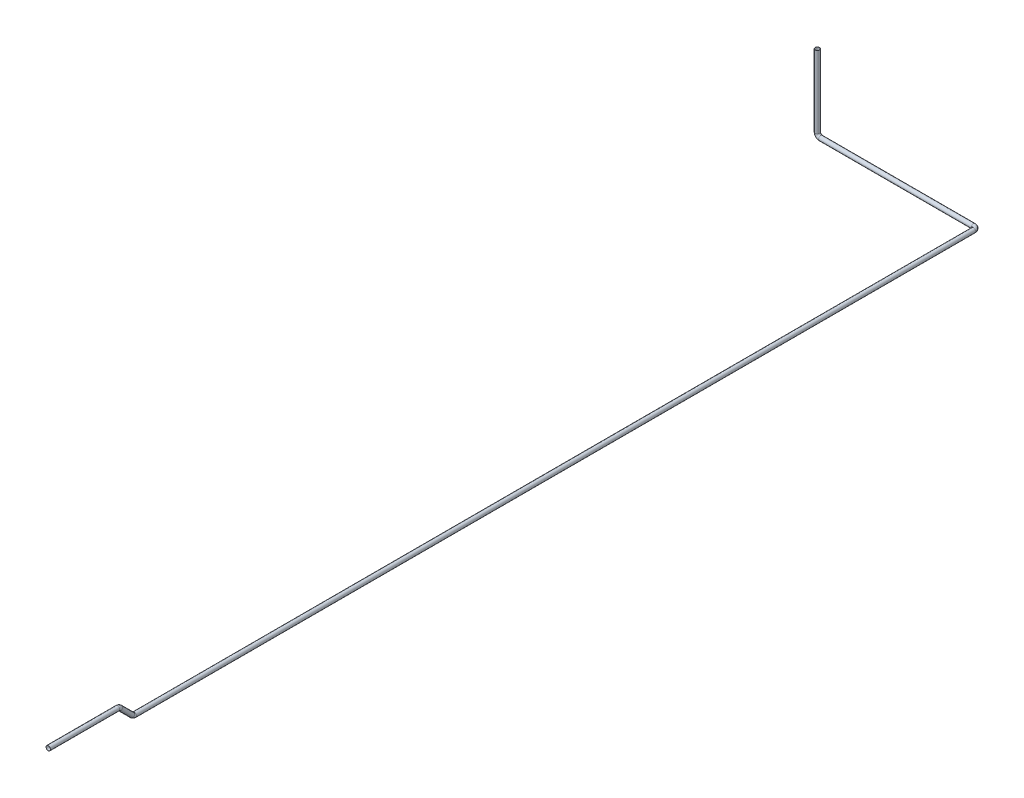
ISO-10303-21;
HEADER;
FILE_DESCRIPTION(('STEP AP214'),'2;1');
FILE_NAME('part.step','',(''),(''),'','','');
FILE_SCHEMA(('AUTOMOTIVE_DESIGN { 1 0 10303 214 1 1 1 1 }'));
ENDSEC;
DATA;
#1=APPLICATION_CONTEXT('core data for automotive mechanical design processes');
#2=APPLICATION_PROTOCOL_DEFINITION('international standard','automotive_design',2000,#1);
#3=PRODUCT_CONTEXT('',#1,'mechanical');
#4=PRODUCT('Part','Part','',(#3));
#5=PRODUCT_RELATED_PRODUCT_CATEGORY('part','',(#4));
#6=PRODUCT_DEFINITION_FORMATION('','',#4);
#7=PRODUCT_DEFINITION_CONTEXT('part definition',#1,'design');
#8=PRODUCT_DEFINITION('design','',#6,#7);
#9=PRODUCT_DEFINITION_SHAPE('','',#8);
#10=(LENGTH_UNIT() NAMED_UNIT(*) SI_UNIT(.MILLI.,.METRE.));
#11=(NAMED_UNIT(*) PLANE_ANGLE_UNIT() SI_UNIT($,.RADIAN.));
#12=(NAMED_UNIT(*) SI_UNIT($,.STERADIAN.) SOLID_ANGLE_UNIT());
#13=UNCERTAINTY_MEASURE_WITH_UNIT(LENGTH_MEASURE(1.E-05),#10,'distance_accuracy_value','');
#14=(GEOMETRIC_REPRESENTATION_CONTEXT(3) GLOBAL_UNCERTAINTY_ASSIGNED_CONTEXT((#13)) GLOBAL_UNIT_ASSIGNED_CONTEXT((#10,
#11,#12)) REPRESENTATION_CONTEXT('',''));
#15=CARTESIAN_POINT('',(0.,0.,0.));
#16=DIRECTION('',(0.,0.,1.));
#17=DIRECTION('',(1.,0.,0.));
#18=AXIS2_PLACEMENT_3D('',#15,#16,#17);
#19=CARTESIAN_POINT('',(2279.99999999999,-880.000000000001,12280.7106781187));
#20=DIRECTION('',(0.,0.,1.));
#21=DIRECTION('',(0.,-1.,0.));
#22=AXIS2_PLACEMENT_3D('',#19,#20,#21);
#23=CYLINDRICAL_SURFACE('',#22,31.75);
#24=CARTESIAN_POINT('',(2279.99999999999,-880.000000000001,12280.7106781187));
#25=DIRECTION('',(0.,0.,-1.));
#26=DIRECTION('',(-1.,0.,0.));
#27=AXIS2_PLACEMENT_3D('',#24,#25,#26);
#28=CIRCLE('',#27,31.75);
#29=CARTESIAN_POINT('',(2279.99999999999,-848.25,12280.7106781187));
#30=VERTEX_POINT('',#29);
#31=EDGE_CURVE('E41',#30,#30,#28,.T.);
#32=ORIENTED_EDGE('',*,*,#31,.F.);
#33=EDGE_LOOP('',(#32));
#34=FACE_BOUND('',#33,.T.);
#35=CARTESIAN_POINT('',(2279.99999999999,-880.000000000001,13270.));
#36=DIRECTION('',(0.,0.,-1.));
#37=DIRECTION('',(-1.,0.,0.));
#38=AXIS2_PLACEMENT_3D('',#35,#36,#37);
#39=CIRCLE('',#38,31.75);
#40=CARTESIAN_POINT('',(2248.24999999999,-880.000000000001,13270.));
#41=VERTEX_POINT('',#40);
#42=EDGE_CURVE('E10',#41,#41,#39,.T.);
#43=ORIENTED_EDGE('',*,*,#42,.T.);
#44=EDGE_LOOP('',(#43));
#45=FACE_BOUND('',#44,.T.);
#46=ADVANCED_FACE('F31',(#34,#45),#23,.T.);
#47=CARTESIAN_POINT('',(2279.99999999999,-880.000000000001,12280.7106781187));
#48=DIRECTION('',(0.,0.,1.));
#49=DIRECTION('',(0.,-1.,0.));
#50=AXIS2_PLACEMENT_3D('',#47,#48,#49);
#51=CYLINDRICAL_SURFACE('',#50,30.);
#52=CARTESIAN_POINT('',(2279.99999999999,-880.000000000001,12280.7106781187));
#53=DIRECTION('',(0.,0.,-1.));
#54=DIRECTION('',(-1.,0.,0.));
#55=AXIS2_PLACEMENT_3D('',#52,#53,#54);
#56=CIRCLE('',#55,30.);
#57=CARTESIAN_POINT('',(2279.99999999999,-850.,12280.7106781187));
#58=VERTEX_POINT('',#57);
#59=EDGE_CURVE('E45',#58,#58,#56,.T.);
#60=ORIENTED_EDGE('',*,*,#59,.T.);
#61=EDGE_LOOP('',(#60));
#62=FACE_BOUND('',#61,.T.);
#63=CARTESIAN_POINT('',(2279.99999999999,-880.000000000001,13270.));
#64=DIRECTION('',(0.,0.,-1.));
#65=DIRECTION('',(-1.,0.,0.));
#66=AXIS2_PLACEMENT_3D('',#63,#64,#65);
#67=CIRCLE('',#66,30.);
#68=CARTESIAN_POINT('',(2249.99999999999,-880.000000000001,13270.));
#69=VERTEX_POINT('',#68);
#70=EDGE_CURVE('E37',#69,#69,#67,.T.);
#71=ORIENTED_EDGE('',*,*,#70,.F.);
#72=EDGE_LOOP('',(#71));
#73=FACE_BOUND('',#72,.T.);
#74=ADVANCED_FACE('F124',(#62,#73),#51,.F.);
#75=CARTESIAN_POINT('',(2280.,-930.,12280.7106781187));
#76=DIRECTION('',(1.,0.,0.));
#77=DIRECTION('',(0.,1.,0.));
#78=AXIS2_PLACEMENT_3D('',#75,#76,#77);
#79=TOROIDAL_SURFACE('',#78,50.0000000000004,31.75);
#80=CARTESIAN_POINT('',(2280.,-894.644660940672,12245.3553390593));
#81=DIRECTION('',(0.,-0.707106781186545,-0.70710678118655));
#82=DIRECTION('',(-1.,0.,0.));
#83=AXIS2_PLACEMENT_3D('',#80,#81,#82);
#84=CIRCLE('',#83,31.75);
#85=CARTESIAN_POINT('',(2279.99999999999,-872.194020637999,12222.9046987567));
#86=VERTEX_POINT('',#85);
#87=EDGE_CURVE('E50',#86,#86,#84,.T.);
#88=CARTESIAN_POINT('',(2280.,-930.,12280.7106781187));
#89=DIRECTION('',(1.,0.,0.));
#90=DIRECTION('',(0.,1.,0.));
#91=AXIS2_PLACEMENT_3D('',#88,#89,#90);
#92=CIRCLE('',#91,81.7500000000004);
#93=EDGE_CURVE('',#86,#30,#92,.T.);
#94=ORIENTED_EDGE('',*,*,#87,.F.);
#95=ORIENTED_EDGE('',*,*,#31,.T.);
#96=ORIENTED_EDGE('',*,*,#93,.T.);
#97=ORIENTED_EDGE('',*,*,#93,.F.);
#98=EDGE_LOOP('',(#94,#96,#95,#97));
#99=FACE_BOUND('',#98,.T.);
#100=ADVANCED_FACE('F129',(#99),#79,.T.);
#101=CARTESIAN_POINT('',(2280.,-930.,12280.7106781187));
#102=DIRECTION('',(1.,0.,0.));
#103=DIRECTION('',(0.,1.,0.));
#104=AXIS2_PLACEMENT_3D('',#101,#102,#103);
#105=TOROIDAL_SURFACE('',#104,50.0000000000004,30.);
#106=CARTESIAN_POINT('',(2280.,-894.644660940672,12245.3553390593));
#107=DIRECTION('',(0.,-0.707106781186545,-0.70710678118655));
#108=DIRECTION('',(-1.,0.,0.));
#109=AXIS2_PLACEMENT_3D('',#106,#107,#108);
#110=CIRCLE('',#109,30.);
#111=CARTESIAN_POINT('',(2279.99999999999,-873.431457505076,12224.1421356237));
#112=VERTEX_POINT('',#111);
#113=EDGE_CURVE('E53',#112,#112,#110,.T.);
#114=CARTESIAN_POINT('',(2280.,-930.,12280.7106781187));
#115=DIRECTION('',(1.,0.,0.));
#116=DIRECTION('',(0.,1.,0.));
#117=AXIS2_PLACEMENT_3D('',#114,#115,#116);
#118=CIRCLE('',#117,80.0000000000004);
#119=EDGE_CURVE('',#112,#58,#118,.T.);
#120=ORIENTED_EDGE('',*,*,#113,.T.);
#121=ORIENTED_EDGE('',*,*,#59,.F.);
#122=ORIENTED_EDGE('',*,*,#119,.T.);
#123=ORIENTED_EDGE('',*,*,#119,.F.);
#124=EDGE_LOOP('',(#120,#122,#121,#123));
#125=FACE_BOUND('',#124,.T.);
#126=ADVANCED_FACE('F134',(#125),#105,.F.);
#127=CARTESIAN_POINT('',(2280.,-1065.35533905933,12074.6446609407));
#128=DIRECTION('',(0.,0.707106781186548,0.707106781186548));
#129=DIRECTION('',(0.,-0.707106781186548,0.707106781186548));
#130=AXIS2_PLACEMENT_3D('',#127,#128,#129);
#131=CYLINDRICAL_SURFACE('',#130,31.75);
#132=CARTESIAN_POINT('',(2280.,-1065.35533905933,12074.6446609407));
#133=DIRECTION('',(0.,-0.707106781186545,-0.70710678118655));
#134=DIRECTION('',(-1.,0.,0.));
#135=AXIS2_PLACEMENT_3D('',#132,#133,#134);
#136=CIRCLE('',#135,31.75);
#137=CARTESIAN_POINT('',(2280.,-1087.805979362,12097.0953012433));
#138=VERTEX_POINT('',#137);
#139=EDGE_CURVE('E56',#138,#138,#136,.T.);
#140=ORIENTED_EDGE('',*,*,#139,.F.);
#141=EDGE_LOOP('',(#140));
#142=FACE_BOUND('',#141,.T.);
#143=ORIENTED_EDGE('',*,*,#87,.T.);
#144=EDGE_LOOP('',(#143));
#145=FACE_BOUND('',#144,.T.);
#146=ADVANCED_FACE('F140',(#142,#145),#131,.T.);
#147=CARTESIAN_POINT('',(2280.,-1065.35533905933,12074.6446609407));
#148=DIRECTION('',(0.,0.707106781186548,0.707106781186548));
#149=DIRECTION('',(0.,-0.707106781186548,0.707106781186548));
#150=AXIS2_PLACEMENT_3D('',#147,#148,#149);
#151=CYLINDRICAL_SURFACE('',#150,30.);
#152=CARTESIAN_POINT('',(2280.,-1065.35533905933,12074.6446609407));
#153=DIRECTION('',(0.,-0.707106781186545,-0.70710678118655));
#154=DIRECTION('',(-1.,0.,0.));
#155=AXIS2_PLACEMENT_3D('',#152,#153,#154);
#156=CIRCLE('',#155,30.);
#157=CARTESIAN_POINT('',(2280.,-1086.56854249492,12095.8578643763));
#158=VERTEX_POINT('',#157);
#159=EDGE_CURVE('E59',#158,#158,#156,.T.);
#160=ORIENTED_EDGE('',*,*,#159,.T.);
#161=EDGE_LOOP('',(#160));
#162=FACE_BOUND('',#161,.T.);
#163=ORIENTED_EDGE('',*,*,#113,.F.);
#164=EDGE_LOOP('',(#163));
#165=FACE_BOUND('',#164,.T.);
#166=ADVANCED_FACE('F147',(#162,#165),#151,.F.);
#167=CARTESIAN_POINT('',(2280.,-1030.,12039.2893218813));
#168=DIRECTION('',(-1.,0.,0.));
#169=DIRECTION('',(0.,-1.,0.));
#170=AXIS2_PLACEMENT_3D('',#167,#168,#169);
#171=TOROIDAL_SURFACE('',#170,49.9999999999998,31.75);
#172=CARTESIAN_POINT('',(2280.,-1080.,12039.2893218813));
#173=DIRECTION('',(0.,0.,-1.));
#174=DIRECTION('',(-1.,0.,0.));
#175=AXIS2_PLACEMENT_3D('',#172,#173,#174);
#176=CIRCLE('',#175,31.75);
#177=CARTESIAN_POINT('',(2280.,-1111.75,12039.2893218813));
#178=VERTEX_POINT('',#177);
#179=EDGE_CURVE('E62',#178,#178,#176,.T.);
#180=CARTESIAN_POINT('',(2280.,-1030.,12039.2893218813));
#181=DIRECTION('',(-1.,0.,0.));
#182=DIRECTION('',(0.,-1.,0.));
#183=AXIS2_PLACEMENT_3D('',#180,#181,#182);
#184=CIRCLE('',#183,81.7499999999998);
#185=EDGE_CURVE('',#178,#138,#184,.T.);
#186=ORIENTED_EDGE('',*,*,#179,.F.);
#187=ORIENTED_EDGE('',*,*,#139,.T.);
#188=ORIENTED_EDGE('',*,*,#185,.T.);
#189=ORIENTED_EDGE('',*,*,#185,.F.);
#190=EDGE_LOOP('',(#186,#188,#187,#189));
#191=FACE_BOUND('',#190,.T.);
#192=ADVANCED_FACE('F151',(#191),#171,.T.);
#193=CARTESIAN_POINT('',(2280.,-1030.,12039.2893218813));
#194=DIRECTION('',(-1.,0.,0.));
#195=DIRECTION('',(0.,-1.,0.));
#196=AXIS2_PLACEMENT_3D('',#193,#194,#195);
#197=TOROIDAL_SURFACE('',#196,49.9999999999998,30.);
#198=CARTESIAN_POINT('',(2280.,-1080.,12039.2893218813));
#199=DIRECTION('',(0.,0.,-1.));
#200=DIRECTION('',(-1.,0.,0.));
#201=AXIS2_PLACEMENT_3D('',#198,#199,#200);
#202=CIRCLE('',#201,30.);
#203=CARTESIAN_POINT('',(2280.,-1110.,12039.2893218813));
#204=VERTEX_POINT('',#203);
#205=EDGE_CURVE('E65',#204,#204,#202,.T.);
#206=CARTESIAN_POINT('',(2280.,-1030.,12039.2893218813));
#207=DIRECTION('',(-1.,0.,0.));
#208=DIRECTION('',(0.,-1.,0.));
#209=AXIS2_PLACEMENT_3D('',#206,#207,#208);
#210=CIRCLE('',#209,79.9999999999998);
#211=EDGE_CURVE('',#204,#158,#210,.T.);
#212=ORIENTED_EDGE('',*,*,#205,.T.);
#213=ORIENTED_EDGE('',*,*,#159,.F.);
#214=ORIENTED_EDGE('',*,*,#211,.T.);
#215=ORIENTED_EDGE('',*,*,#211,.F.);
#216=EDGE_LOOP('',(#212,#214,#213,#215));
#217=FACE_BOUND('',#216,.T.);
#218=ADVANCED_FACE('F155',(#217),#197,.F.);
#219=CARTESIAN_POINT('',(2280.,-1080.,49.9999999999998));
#220=DIRECTION('',(0.,0.,1.));
#221=DIRECTION('',(1.,0.,0.));
#222=AXIS2_PLACEMENT_3D('',#219,#220,#221);
#223=CYLINDRICAL_SURFACE('',#222,31.75);
#224=CARTESIAN_POINT('',(2280.,-1080.,49.9999999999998));
#225=DIRECTION('',(0.,0.,-1.));
#226=DIRECTION('',(-1.,0.,0.));
#227=AXIS2_PLACEMENT_3D('',#224,#225,#226);
#228=CIRCLE('',#227,31.75);
#229=CARTESIAN_POINT('',(2311.75,-1080.,49.9999999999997));
#230=VERTEX_POINT('',#229);
#231=EDGE_CURVE('E68',#230,#230,#228,.T.);
#232=ORIENTED_EDGE('',*,*,#231,.F.);
#233=EDGE_LOOP('',(#232));
#234=FACE_BOUND('',#233,.T.);
#235=ORIENTED_EDGE('',*,*,#179,.T.);
#236=EDGE_LOOP('',(#235));
#237=FACE_BOUND('',#236,.T.);
#238=ADVANCED_FACE('F159',(#234,#237),#223,.T.);
#239=CARTESIAN_POINT('',(2280.,-1080.,49.9999999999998));
#240=DIRECTION('',(0.,0.,1.));
#241=DIRECTION('',(1.,0.,0.));
#242=AXIS2_PLACEMENT_3D('',#239,#240,#241);
#243=CYLINDRICAL_SURFACE('',#242,30.);
#244=CARTESIAN_POINT('',(2280.,-1080.,49.9999999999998));
#245=DIRECTION('',(0.,0.,-1.));
#246=DIRECTION('',(-1.,0.,0.));
#247=AXIS2_PLACEMENT_3D('',#244,#245,#246);
#248=CIRCLE('',#247,30.);
#249=CARTESIAN_POINT('',(2310.,-1080.,49.9999999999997));
#250=VERTEX_POINT('',#249);
#251=EDGE_CURVE('E71',#250,#250,#248,.T.);
#252=ORIENTED_EDGE('',*,*,#251,.T.);
#253=EDGE_LOOP('',(#252));
#254=FACE_BOUND('',#253,.T.);
#255=ORIENTED_EDGE('',*,*,#205,.F.);
#256=EDGE_LOOP('',(#255));
#257=FACE_BOUND('',#256,.T.);
#258=ADVANCED_FACE('F163',(#254,#257),#243,.F.);
#259=CARTESIAN_POINT('',(2230.,-1080.,50.));
#260=DIRECTION('',(0.,-1.,0.));
#261=DIRECTION('',(0.,0.,-1.));
#262=AXIS2_PLACEMENT_3D('',#259,#260,#261);
#263=TOROIDAL_SURFACE('',#262,50.,31.75);
#264=CARTESIAN_POINT('',(2230.,-1080.,0.));
#265=DIRECTION('',(-1.,0.,0.));
#266=DIRECTION('',(0.,0.,1.));
#267=AXIS2_PLACEMENT_3D('',#264,#265,#266);
#268=CIRCLE('',#267,31.75);
#269=CARTESIAN_POINT('',(2230.,-1080.,-31.75));
#270=VERTEX_POINT('',#269);
#271=EDGE_CURVE('E74',#270,#270,#268,.T.);
#272=CARTESIAN_POINT('',(2230.,-1080.,50.));
#273=DIRECTION('',(0.,-1.,0.));
#274=DIRECTION('',(0.,0.,-1.));
#275=AXIS2_PLACEMENT_3D('',#272,#273,#274);
#276=CIRCLE('',#275,81.75);
#277=EDGE_CURVE('',#270,#230,#276,.T.);
#278=ORIENTED_EDGE('',*,*,#271,.F.);
#279=ORIENTED_EDGE('',*,*,#231,.T.);
#280=ORIENTED_EDGE('',*,*,#277,.T.);
#281=ORIENTED_EDGE('',*,*,#277,.F.);
#282=EDGE_LOOP('',(#278,#280,#279,#281));
#283=FACE_BOUND('',#282,.T.);
#284=ADVANCED_FACE('F167',(#283),#263,.T.);
#285=CARTESIAN_POINT('',(2230.,-1080.,50.));
#286=DIRECTION('',(0.,-1.,0.));
#287=DIRECTION('',(0.,0.,-1.));
#288=AXIS2_PLACEMENT_3D('',#285,#286,#287);
#289=TOROIDAL_SURFACE('',#288,50.,30.);
#290=CARTESIAN_POINT('',(2230.,-1080.,0.));
#291=DIRECTION('',(-1.,0.,0.));
#292=DIRECTION('',(0.,0.,1.));
#293=AXIS2_PLACEMENT_3D('',#290,#291,#292);
#294=CIRCLE('',#293,30.);
#295=CARTESIAN_POINT('',(2230.,-1080.,-30.));
#296=VERTEX_POINT('',#295);
#297=EDGE_CURVE('E77',#296,#296,#294,.T.);
#298=CARTESIAN_POINT('',(2230.,-1080.,50.));
#299=DIRECTION('',(0.,-1.,0.));
#300=DIRECTION('',(0.,0.,-1.));
#301=AXIS2_PLACEMENT_3D('',#298,#299,#300);
#302=CIRCLE('',#301,80.);
#303=EDGE_CURVE('',#296,#250,#302,.T.);
#304=ORIENTED_EDGE('',*,*,#297,.T.);
#305=ORIENTED_EDGE('',*,*,#251,.F.);
#306=ORIENTED_EDGE('',*,*,#303,.T.);
#307=ORIENTED_EDGE('',*,*,#303,.F.);
#308=EDGE_LOOP('',(#304,#306,#305,#307));
#309=FACE_BOUND('',#308,.T.);
#310=ADVANCED_FACE('F171',(#309),#289,.F.);
#311=CARTESIAN_POINT('',(50.,-1080.,0.));
#312=DIRECTION('',(1.,0.,0.));
#313=DIRECTION('',(0.,0.,-1.));
#314=AXIS2_PLACEMENT_3D('',#311,#312,#313);
#315=CYLINDRICAL_SURFACE('',#314,31.75);
#316=CARTESIAN_POINT('',(50.,-1080.,0.));
#317=DIRECTION('',(-1.,0.,0.));
#318=DIRECTION('',(0.,0.,1.));
#319=AXIS2_PLACEMENT_3D('',#316,#317,#318);
#320=CIRCLE('',#319,31.75);
#321=CARTESIAN_POINT('',(50.0000000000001,-1111.75,0.));
#322=VERTEX_POINT('',#321);
#323=EDGE_CURVE('E80',#322,#322,#320,.T.);
#324=ORIENTED_EDGE('',*,*,#323,.F.);
#325=EDGE_LOOP('',(#324));
#326=FACE_BOUND('',#325,.T.);
#327=ORIENTED_EDGE('',*,*,#271,.T.);
#328=EDGE_LOOP('',(#327));
#329=FACE_BOUND('',#328,.T.);
#330=ADVANCED_FACE('F175',(#326,#329),#315,.T.);
#331=CARTESIAN_POINT('',(50.,-1080.,0.));
#332=DIRECTION('',(1.,0.,0.));
#333=DIRECTION('',(0.,0.,-1.));
#334=AXIS2_PLACEMENT_3D('',#331,#332,#333);
#335=CYLINDRICAL_SURFACE('',#334,30.);
#336=CARTESIAN_POINT('',(50.,-1080.,0.));
#337=DIRECTION('',(-1.,0.,0.));
#338=DIRECTION('',(0.,0.,1.));
#339=AXIS2_PLACEMENT_3D('',#336,#337,#338);
#340=CIRCLE('',#339,30.);
#341=CARTESIAN_POINT('',(50.0000000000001,-1110.,0.));
#342=VERTEX_POINT('',#341);
#343=EDGE_CURVE('E83',#342,#342,#340,.T.);
#344=ORIENTED_EDGE('',*,*,#343,.T.);
#345=EDGE_LOOP('',(#344));
#346=FACE_BOUND('',#345,.T.);
#347=ORIENTED_EDGE('',*,*,#297,.F.);
#348=EDGE_LOOP('',(#347));
#349=FACE_BOUND('',#348,.T.);
#350=ADVANCED_FACE('F179',(#346,#349),#335,.F.);
#351=CARTESIAN_POINT('',(50.,-1030.,0.));
#352=DIRECTION('',(0.,0.,1.));
#353=DIRECTION('',(1.,0.,0.));
#354=AXIS2_PLACEMENT_3D('',#351,#352,#353);
#355=TOROIDAL_SURFACE('',#354,50.,31.75);
#356=CARTESIAN_POINT('',(0.,-1030.,0.));
#357=DIRECTION('',(0.,1.,0.));
#358=DIRECTION('',(0.,0.,1.));
#359=AXIS2_PLACEMENT_3D('',#356,#357,#358);
#360=CIRCLE('',#359,31.75);
#361=CARTESIAN_POINT('',(-31.75,-1030.,0.));
#362=VERTEX_POINT('',#361);
#363=EDGE_CURVE('E86',#362,#362,#360,.T.);
#364=CARTESIAN_POINT('',(50.,-1030.,0.));
#365=DIRECTION('',(0.,0.,1.));
#366=DIRECTION('',(1.,0.,0.));
#367=AXIS2_PLACEMENT_3D('',#364,#365,#366);
#368=CIRCLE('',#367,81.75);
#369=EDGE_CURVE('',#362,#322,#368,.T.);
#370=ORIENTED_EDGE('',*,*,#363,.F.);
#371=ORIENTED_EDGE('',*,*,#323,.T.);
#372=ORIENTED_EDGE('',*,*,#369,.T.);
#373=ORIENTED_EDGE('',*,*,#369,.F.);
#374=EDGE_LOOP('',(#370,#372,#371,#373));
#375=FACE_BOUND('',#374,.T.);
#376=ADVANCED_FACE('F183',(#375),#355,.T.);
#377=CARTESIAN_POINT('',(50.,-1030.,0.));
#378=DIRECTION('',(0.,0.,1.));
#379=DIRECTION('',(1.,0.,0.));
#380=AXIS2_PLACEMENT_3D('',#377,#378,#379);
#381=TOROIDAL_SURFACE('',#380,50.,30.);
#382=CARTESIAN_POINT('',(0.,-1030.,0.));
#383=DIRECTION('',(0.,1.,0.));
#384=DIRECTION('',(0.,0.,1.));
#385=AXIS2_PLACEMENT_3D('',#382,#383,#384);
#386=CIRCLE('',#385,30.);
#387=CARTESIAN_POINT('',(-30.,-1030.,0.));
#388=VERTEX_POINT('',#387);
#389=EDGE_CURVE('E90',#388,#388,#386,.T.);
#390=CARTESIAN_POINT('',(50.,-1030.,0.));
#391=DIRECTION('',(0.,0.,1.));
#392=DIRECTION('',(1.,0.,0.));
#393=AXIS2_PLACEMENT_3D('',#390,#391,#392);
#394=CIRCLE('',#393,80.);
#395=EDGE_CURVE('',#388,#342,#394,.T.);
#396=ORIENTED_EDGE('',*,*,#389,.T.);
#397=ORIENTED_EDGE('',*,*,#343,.F.);
#398=ORIENTED_EDGE('',*,*,#395,.T.);
#399=ORIENTED_EDGE('',*,*,#395,.F.);
#400=EDGE_LOOP('',(#396,#398,#397,#399));
#401=FACE_BOUND('',#400,.T.);
#402=ADVANCED_FACE('F99',(#401),#381,.F.);
#403=CARTESIAN_POINT('',(0.,-1030.,0.));
#404=DIRECTION('',(0.,1.,0.));
#405=DIRECTION('',(0.,0.,1.));
#406=AXIS2_PLACEMENT_3D('',#403,#404,#405);
#407=CYLINDRICAL_SURFACE('',#406,30.);
#408=ORIENTED_EDGE('',*,*,#389,.F.);
#409=EDGE_LOOP('',(#408));
#410=FACE_BOUND('',#409,.T.);
#411=CARTESIAN_POINT('',(0.,0.,0.));
#412=DIRECTION('',(0.,1.,0.));
#413=DIRECTION('',(0.,0.,1.));
#414=AXIS2_PLACEMENT_3D('',#411,#412,#413);
#415=CIRCLE('',#414,30.);
#416=CARTESIAN_POINT('',(0.,0.,30.));
#417=VERTEX_POINT('',#416);
#418=EDGE_CURVE('E91',#417,#417,#415,.T.);
#419=ORIENTED_EDGE('',*,*,#418,.T.);
#420=EDGE_LOOP('',(#419));
#421=FACE_BOUND('',#420,.T.);
#422=ADVANCED_FACE('F102',(#410,#421),#407,.F.);
#423=CARTESIAN_POINT('',(0.,-1030.,0.));
#424=DIRECTION('',(0.,1.,0.));
#425=DIRECTION('',(0.,0.,1.));
#426=AXIS2_PLACEMENT_3D('',#423,#424,#425);
#427=CYLINDRICAL_SURFACE('',#426,31.75);
#428=ORIENTED_EDGE('',*,*,#363,.T.);
#429=EDGE_LOOP('',(#428));
#430=FACE_BOUND('',#429,.T.);
#431=CARTESIAN_POINT('',(0.,0.,0.));
#432=DIRECTION('',(0.,1.,0.));
#433=DIRECTION('',(0.,0.,1.));
#434=AXIS2_PLACEMENT_3D('',#431,#432,#433);
#435=CIRCLE('',#434,31.75);
#436=CARTESIAN_POINT('',(0.,0.,31.75));
#437=VERTEX_POINT('',#436);
#438=EDGE_CURVE('E87',#437,#437,#435,.T.);
#439=ORIENTED_EDGE('',*,*,#438,.F.);
#440=EDGE_LOOP('',(#439));
#441=FACE_BOUND('',#440,.T.);
#442=ADVANCED_FACE('F105',(#430,#441),#427,.T.);
#443=CARTESIAN_POINT('',(2279.99999999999,-880.000000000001,13270.));
#444=DIRECTION('',(0.,0.,-1.));
#445=DIRECTION('',(-1.,0.,0.));
#446=AXIS2_PLACEMENT_3D('',#443,#444,#445);
#447=PLANE('',#446);
#448=ORIENTED_EDGE('',*,*,#70,.T.);
#449=EDGE_LOOP('',(#448));
#450=FACE_BOUND('',#449,.T.);
#451=ORIENTED_EDGE('',*,*,#42,.F.);
#452=EDGE_LOOP('',(#451));
#453=FACE_BOUND('',#452,.T.);
#454=ADVANCED_FACE('F112',(#450,#453),#447,.F.);
#455=CARTESIAN_POINT('',(0.,0.,0.));
#456=DIRECTION('',(0.,1.,0.));
#457=DIRECTION('',(0.,0.,1.));
#458=AXIS2_PLACEMENT_3D('',#455,#456,#457);
#459=PLANE('',#458);
#460=ORIENTED_EDGE('',*,*,#418,.F.);
#461=EDGE_LOOP('',(#460));
#462=FACE_BOUND('',#461,.T.);
#463=ORIENTED_EDGE('',*,*,#438,.T.);
#464=EDGE_LOOP('',(#463));
#465=FACE_BOUND('',#464,.T.);
#466=ADVANCED_FACE('F109',(#462,#465),#459,.T.);
#467=CLOSED_SHELL('',(#46,#74,#100,#126,#146,#166,#192,#218,#238,#258,#284,#310,#330,#350,#376,
#402,#422,#442,#454,#466));
#468=MANIFOLD_SOLID_BREP('B2',#467);
#469=ADVANCED_BREP_SHAPE_REPRESENTATION('',(#18,#468),#14);
#470=SHAPE_DEFINITION_REPRESENTATION(#9,#469);
ENDSEC;
END-ISO-10303-21;
